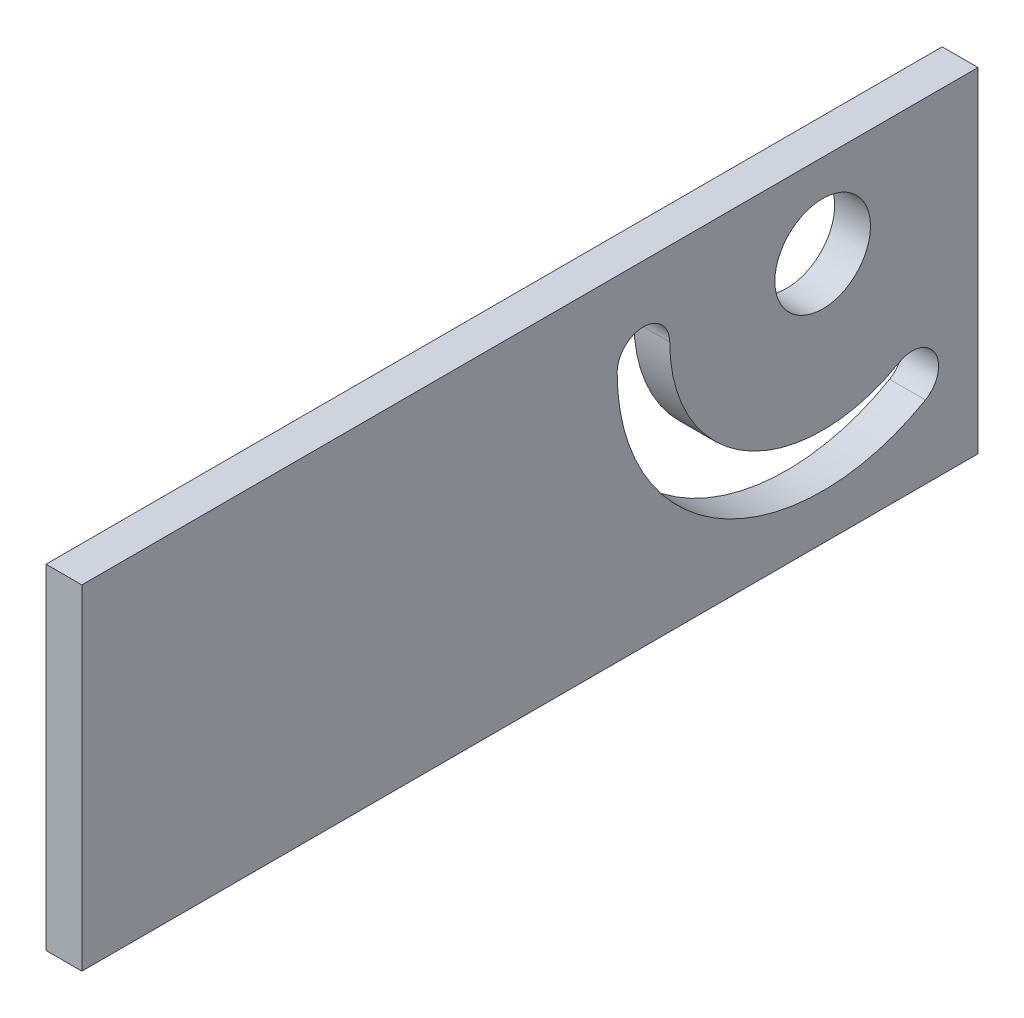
ISO-10303-21;
HEADER;
FILE_DESCRIPTION(('STEP AP214'),'2;1');
FILE_NAME('part.step','',(''),(''),'','','');
FILE_SCHEMA(('AUTOMOTIVE_DESIGN { 1 0 10303 214 1 1 1 1 }'));
ENDSEC;
DATA;
#1=APPLICATION_CONTEXT('core data for automotive mechanical design processes');
#2=APPLICATION_PROTOCOL_DEFINITION('international standard','automotive_design',2000,#1);
#3=PRODUCT_CONTEXT('',#1,'mechanical');
#4=PRODUCT('Part','Part','',(#3));
#5=PRODUCT_RELATED_PRODUCT_CATEGORY('part','',(#4));
#6=PRODUCT_DEFINITION_FORMATION('','',#4);
#7=PRODUCT_DEFINITION_CONTEXT('part definition',#1,'design');
#8=PRODUCT_DEFINITION('design','',#6,#7);
#9=PRODUCT_DEFINITION_SHAPE('','',#8);
#10=(LENGTH_UNIT() NAMED_UNIT(*) SI_UNIT(.MILLI.,.METRE.));
#11=(NAMED_UNIT(*) PLANE_ANGLE_UNIT() SI_UNIT($,.RADIAN.));
#12=(NAMED_UNIT(*) SI_UNIT($,.STERADIAN.) SOLID_ANGLE_UNIT());
#13=UNCERTAINTY_MEASURE_WITH_UNIT(LENGTH_MEASURE(1.E-05),#10,'distance_accuracy_value','');
#14=(GEOMETRIC_REPRESENTATION_CONTEXT(3) GLOBAL_UNCERTAINTY_ASSIGNED_CONTEXT((#13)) GLOBAL_UNIT_ASSIGNED_CONTEXT((#10,
#11,#12)) REPRESENTATION_CONTEXT('',''));
#15=CARTESIAN_POINT('',(0.,0.,0.));
#16=DIRECTION('',(0.,0.,1.));
#17=DIRECTION('',(1.,0.,0.));
#18=AXIS2_PLACEMENT_3D('',#15,#16,#17);
#19=CARTESIAN_POINT('',(-64.,87.,50.5));
#20=DIRECTION('',(1.,0.,0.));
#21=DIRECTION('',(0.,0.,-1.));
#22=AXIS2_PLACEMENT_3D('',#19,#20,#21);
#23=CYLINDRICAL_SURFACE('',#22,17.2);
#24=CARTESIAN_POINT('',(-61.,87.,50.5));
#25=DIRECTION('',(-1.,0.,0.));
#26=DIRECTION('',(0.,0.,1.));
#27=AXIS2_PLACEMENT_3D('',#24,#25,#26);
#28=CIRCLE('',#27,17.2);
#29=CARTESIAN_POINT('',(-61.,72.1043630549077,41.8999999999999));
#30=VERTEX_POINT('',#29);
#31=CARTESIAN_POINT('',(-61.,87.,67.7));
#32=VERTEX_POINT('',#31);
#33=EDGE_CURVE('E150',#30,#32,#28,.T.);
#34=ORIENTED_EDGE('',*,*,#33,.F.);
#35=DIRECTION('',(1.,0.,0.));
#36=VECTOR('',#35,1.);
#37=CARTESIAN_POINT('',(-64.,72.1043630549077,41.8999999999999));
#38=LINE('',#37,#36);
#39=CARTESIAN_POINT('',(-64.,72.1043630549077,41.8999999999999));
#40=VERTEX_POINT('',#39);
#41=EDGE_CURVE('E11',#40,#30,#38,.T.);
#42=ORIENTED_EDGE('',*,*,#41,.F.);
#43=CARTESIAN_POINT('',(-64.,87.,50.5));
#44=DIRECTION('',(-1.,0.,0.));
#45=DIRECTION('',(0.,0.,1.));
#46=AXIS2_PLACEMENT_3D('',#43,#44,#45);
#47=CIRCLE('',#46,17.2);
#48=CARTESIAN_POINT('',(-64.,87.,67.7));
#49=VERTEX_POINT('',#48);
#50=EDGE_CURVE('E121',#40,#49,#47,.T.);
#51=ORIENTED_EDGE('',*,*,#50,.T.);
#52=DIRECTION('',(1.,0.,0.));
#53=VECTOR('',#52,1.);
#54=CARTESIAN_POINT('',(-64.,87.,67.7));
#55=LINE('',#54,#53);
#56=EDGE_CURVE('E54',#49,#32,#55,.T.);
#57=ORIENTED_EDGE('',*,*,#56,.T.);
#58=EDGE_LOOP('',(#34,#42,#51,#57));
#59=FACE_BOUND('',#58,.T.);
#60=ADVANCED_FACE('F35',(#59),#23,.F.);
#61=CARTESIAN_POINT('',(-64.,74.0096189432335,42.9999999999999));
#62=DIRECTION('',(1.,0.,0.));
#63=DIRECTION('',(0.,0.,-1.));
#64=AXIS2_PLACEMENT_3D('',#61,#62,#63);
#65=CYLINDRICAL_SURFACE('',#64,2.2);
#66=CARTESIAN_POINT('',(-61.,74.0096189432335,42.9999999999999));
#67=DIRECTION('',(-1.,0.,0.));
#68=DIRECTION('',(0.,0.,1.));
#69=AXIS2_PLACEMENT_3D('',#66,#67,#68);
#70=CIRCLE('',#69,2.2);
#71=CARTESIAN_POINT('',(-61.,75.9148748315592,44.0999999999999));
#72=VERTEX_POINT('',#71);
#73=EDGE_CURVE('E126',#30,#72,#70,.F.);
#74=ORIENTED_EDGE('',*,*,#73,.T.);
#75=DIRECTION('',(1.,0.,0.));
#76=VECTOR('',#75,1.);
#77=CARTESIAN_POINT('',(-64.,75.9148748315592,44.0999999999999));
#78=LINE('',#77,#76);
#79=CARTESIAN_POINT('',(-64.,75.9148748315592,44.0999999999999));
#80=VERTEX_POINT('',#79);
#81=EDGE_CURVE('E45',#80,#72,#78,.T.);
#82=ORIENTED_EDGE('',*,*,#81,.F.);
#83=CARTESIAN_POINT('',(-64.,74.0096189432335,42.9999999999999));
#84=DIRECTION('',(-1.,0.,0.));
#85=DIRECTION('',(0.,0.,1.));
#86=AXIS2_PLACEMENT_3D('',#83,#84,#85);
#87=CIRCLE('',#86,2.2);
#88=EDGE_CURVE('E116',#40,#80,#87,.F.);
#89=ORIENTED_EDGE('',*,*,#88,.F.);
#90=ORIENTED_EDGE('',*,*,#41,.T.);
#91=EDGE_LOOP('',(#74,#82,#89,#90));
#92=FACE_BOUND('',#91,.T.);
#93=ADVANCED_FACE('F124',(#92),#65,.F.);
#94=CARTESIAN_POINT('',(-64.,87.,50.5));
#95=DIRECTION('',(1.,0.,0.));
#96=DIRECTION('',(0.,0.,-1.));
#97=AXIS2_PLACEMENT_3D('',#94,#95,#96);
#98=CYLINDRICAL_SURFACE('',#97,12.8);
#99=CARTESIAN_POINT('',(-61.,87.,50.5));
#100=DIRECTION('',(-1.,0.,0.));
#101=DIRECTION('',(0.,0.,1.));
#102=AXIS2_PLACEMENT_3D('',#99,#100,#101);
#103=CIRCLE('',#102,12.8);
#104=CARTESIAN_POINT('',(-61.,87.,63.3));
#105=VERTEX_POINT('',#104);
#106=EDGE_CURVE('E147',#72,#105,#103,.T.);
#107=ORIENTED_EDGE('',*,*,#106,.T.);
#108=DIRECTION('',(1.,0.,0.));
#109=VECTOR('',#108,1.);
#110=CARTESIAN_POINT('',(-64.,87.,63.3));
#111=LINE('',#110,#109);
#112=CARTESIAN_POINT('',(-64.,87.,63.3));
#113=VERTEX_POINT('',#112);
#114=EDGE_CURVE('E80',#113,#105,#111,.T.);
#115=ORIENTED_EDGE('',*,*,#114,.F.);
#116=CARTESIAN_POINT('',(-64.,87.,50.5));
#117=DIRECTION('',(-1.,0.,0.));
#118=DIRECTION('',(0.,0.,1.));
#119=AXIS2_PLACEMENT_3D('',#116,#117,#118);
#120=CIRCLE('',#119,12.8);
#121=EDGE_CURVE('E108',#80,#113,#120,.T.);
#122=ORIENTED_EDGE('',*,*,#121,.F.);
#123=ORIENTED_EDGE('',*,*,#81,.T.);
#124=EDGE_LOOP('',(#107,#115,#122,#123));
#125=FACE_BOUND('',#124,.T.);
#126=ADVANCED_FACE('F110',(#125),#98,.T.);
#127=CARTESIAN_POINT('',(-64.,0.,112.5));
#128=DIRECTION('',(0.,0.,-1.));
#129=DIRECTION('',(-1.,0.,0.));
#130=AXIS2_PLACEMENT_3D('',#127,#128,#129);
#131=PLANE('',#130);
#132=DIRECTION('',(0.,1.,0.));
#133=VECTOR('',#132,1.);
#134=CARTESIAN_POINT('',(-61.,0.,112.5));
#135=LINE('',#134,#133);
#136=CARTESIAN_POINT('',(-61.,66.,112.5));
#137=VERTEX_POINT('',#136);
#138=CARTESIAN_POINT('',(-61.,94.,112.5));
#139=VERTEX_POINT('',#138);
#140=EDGE_CURVE('E162',#137,#139,#135,.T.);
#141=ORIENTED_EDGE('',*,*,#140,.T.);
#142=DIRECTION('',(1.,0.,0.));
#143=VECTOR('',#142,1.);
#144=CARTESIAN_POINT('',(-64.,94.,112.5));
#145=LINE('',#144,#143);
#146=CARTESIAN_POINT('',(-64.,94.,112.5));
#147=VERTEX_POINT('',#146);
#148=EDGE_CURVE('E39',#147,#139,#145,.T.);
#149=ORIENTED_EDGE('',*,*,#148,.F.);
#150=DIRECTION('',(0.,1.,0.));
#151=VECTOR('',#150,1.);
#152=CARTESIAN_POINT('',(-64.,0.,112.5));
#153=LINE('',#152,#151);
#154=CARTESIAN_POINT('',(-64.,66.,112.5));
#155=VERTEX_POINT('',#154);
#156=EDGE_CURVE('E146',#155,#147,#153,.T.);
#157=ORIENTED_EDGE('',*,*,#156,.F.);
#158=DIRECTION('',(1.,0.,0.));
#159=VECTOR('',#158,1.);
#160=CARTESIAN_POINT('',(-64.,66.,112.5));
#161=LINE('',#160,#159);
#162=EDGE_CURVE('E131',#155,#137,#161,.T.);
#163=ORIENTED_EDGE('',*,*,#162,.T.);
#164=EDGE_LOOP('',(#141,#149,#157,#163));
#165=FACE_BOUND('',#164,.T.);
#166=ADVANCED_FACE('F37',(#165),#131,.F.);
#167=CARTESIAN_POINT('',(-64.,94.,0.));
#168=DIRECTION('',(0.,-1.,0.));
#169=DIRECTION('',(0.,0.,-1.));
#170=AXIS2_PLACEMENT_3D('',#167,#168,#169);
#171=PLANE('',#170);
#172=DIRECTION('',(0.,0.,-1.));
#173=VECTOR('',#172,1.);
#174=CARTESIAN_POINT('',(-61.,94.,0.));
#175=LINE('',#174,#173);
#176=CARTESIAN_POINT('',(-61.,94.,37.5));
#177=VERTEX_POINT('',#176);
#178=EDGE_CURVE('E160',#139,#177,#175,.T.);
#179=ORIENTED_EDGE('',*,*,#178,.T.);
#180=DIRECTION('',(1.,0.,0.));
#181=VECTOR('',#180,1.);
#182=CARTESIAN_POINT('',(-64.,94.,37.5));
#183=LINE('',#182,#181);
#184=CARTESIAN_POINT('',(-64.,94.,37.5));
#185=VERTEX_POINT('',#184);
#186=EDGE_CURVE('E135',#185,#177,#183,.T.);
#187=ORIENTED_EDGE('',*,*,#186,.F.);
#188=DIRECTION('',(0.,0.,-1.));
#189=VECTOR('',#188,1.);
#190=CARTESIAN_POINT('',(-64.,94.,0.));
#191=LINE('',#190,#189);
#192=EDGE_CURVE('E93',#147,#185,#191,.T.);
#193=ORIENTED_EDGE('',*,*,#192,.F.);
#194=ORIENTED_EDGE('',*,*,#148,.T.);
#195=EDGE_LOOP('',(#179,#187,#193,#194));
#196=FACE_BOUND('',#195,.T.);
#197=ADVANCED_FACE('F186',(#196),#171,.F.);
#198=CARTESIAN_POINT('',(-64.,0.,37.5));
#199=DIRECTION('',(0.,0.,-1.));
#200=DIRECTION('',(-1.,0.,0.));
#201=AXIS2_PLACEMENT_3D('',#198,#199,#200);
#202=PLANE('',#201);
#203=DIRECTION('',(0.,1.,0.));
#204=VECTOR('',#203,1.);
#205=CARTESIAN_POINT('',(-61.,0.,37.5));
#206=LINE('',#205,#204);
#207=CARTESIAN_POINT('',(-61.,66.,37.5));
#208=VERTEX_POINT('',#207);
#209=EDGE_CURVE('E157',#208,#177,#206,.T.);
#210=ORIENTED_EDGE('',*,*,#209,.F.);
#211=DIRECTION('',(1.,0.,0.));
#212=VECTOR('',#211,1.);
#213=CARTESIAN_POINT('',(-64.,66.,37.5));
#214=LINE('',#213,#212);
#215=CARTESIAN_POINT('',(-64.,66.,37.5));
#216=VERTEX_POINT('',#215);
#217=EDGE_CURVE('E134',#216,#208,#214,.T.);
#218=ORIENTED_EDGE('',*,*,#217,.F.);
#219=DIRECTION('',(0.,1.,0.));
#220=VECTOR('',#219,1.);
#221=CARTESIAN_POINT('',(-64.,0.,37.5));
#222=LINE('',#221,#220);
#223=EDGE_CURVE('E171',#216,#185,#222,.T.);
#224=ORIENTED_EDGE('',*,*,#223,.T.);
#225=ORIENTED_EDGE('',*,*,#186,.T.);
#226=EDGE_LOOP('',(#210,#218,#224,#225));
#227=FACE_BOUND('',#226,.T.);
#228=ADVANCED_FACE('F187',(#227),#202,.T.);
#229=CARTESIAN_POINT('',(-64.,87.,50.5));
#230=DIRECTION('',(1.,0.,0.));
#231=DIRECTION('',(0.,0.,-1.));
#232=AXIS2_PLACEMENT_3D('',#229,#230,#231);
#233=CYLINDRICAL_SURFACE('',#232,4.00000000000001);
#234=CARTESIAN_POINT('',(-64.,87.,50.5));
#235=DIRECTION('',(-1.,0.,0.));
#236=DIRECTION('',(0.,0.,1.));
#237=AXIS2_PLACEMENT_3D('',#234,#235,#236);
#238=CIRCLE('',#237,4.00000000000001);
#239=CARTESIAN_POINT('',(-64.,87.,54.5));
#240=VERTEX_POINT('',#239);
#241=EDGE_CURVE('E166',#240,#240,#238,.F.);
#242=ORIENTED_EDGE('',*,*,#241,.F.);
#243=EDGE_LOOP('',(#242));
#244=FACE_BOUND('',#243,.T.);
#245=CARTESIAN_POINT('',(-61.,87.,50.5));
#246=DIRECTION('',(-1.,0.,0.));
#247=DIRECTION('',(0.,0.,1.));
#248=AXIS2_PLACEMENT_3D('',#245,#246,#247);
#249=CIRCLE('',#248,4.00000000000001);
#250=CARTESIAN_POINT('',(-61.,87.,54.5));
#251=VERTEX_POINT('',#250);
#252=EDGE_CURVE('E152',#251,#251,#249,.F.);
#253=ORIENTED_EDGE('',*,*,#252,.T.);
#254=EDGE_LOOP('',(#253));
#255=FACE_BOUND('',#254,.T.);
#256=ADVANCED_FACE('F192',(#244,#255),#233,.F.);
#257=CARTESIAN_POINT('',(-64.,66.,0.));
#258=DIRECTION('',(0.,1.,0.));
#259=DIRECTION('',(0.,0.,1.));
#260=AXIS2_PLACEMENT_3D('',#257,#258,#259);
#261=PLANE('',#260);
#262=DIRECTION('',(0.,0.,1.));
#263=VECTOR('',#262,1.);
#264=CARTESIAN_POINT('',(-61.,66.,0.));
#265=LINE('',#264,#263);
#266=EDGE_CURVE('E155',#208,#137,#265,.T.);
#267=ORIENTED_EDGE('',*,*,#266,.T.);
#268=ORIENTED_EDGE('',*,*,#162,.F.);
#269=DIRECTION('',(0.,0.,1.));
#270=VECTOR('',#269,1.);
#271=CARTESIAN_POINT('',(-64.,66.,0.));
#272=LINE('',#271,#270);
#273=EDGE_CURVE('E169',#216,#155,#272,.T.);
#274=ORIENTED_EDGE('',*,*,#273,.F.);
#275=ORIENTED_EDGE('',*,*,#217,.T.);
#276=EDGE_LOOP('',(#267,#268,#274,#275));
#277=FACE_BOUND('',#276,.T.);
#278=ADVANCED_FACE('F189',(#277),#261,.F.);
#279=CARTESIAN_POINT('',(-64.,87.,65.5));
#280=DIRECTION('',(1.,0.,0.));
#281=DIRECTION('',(0.,0.,-1.));
#282=AXIS2_PLACEMENT_3D('',#279,#280,#281);
#283=CYLINDRICAL_SURFACE('',#282,2.20000000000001);
#284=CARTESIAN_POINT('',(-61.,87.,65.5));
#285=DIRECTION('',(-1.,0.,0.));
#286=DIRECTION('',(0.,0.,1.));
#287=AXIS2_PLACEMENT_3D('',#284,#285,#286);
#288=CIRCLE('',#287,2.20000000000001);
#289=EDGE_CURVE('E143',#32,#105,#288,.T.);
#290=ORIENTED_EDGE('',*,*,#289,.F.);
#291=ORIENTED_EDGE('',*,*,#56,.F.);
#292=CARTESIAN_POINT('',(-64.,87.,65.5));
#293=DIRECTION('',(-1.,0.,0.));
#294=DIRECTION('',(0.,0.,1.));
#295=AXIS2_PLACEMENT_3D('',#292,#293,#294);
#296=CIRCLE('',#295,2.20000000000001);
#297=EDGE_CURVE('E115',#49,#113,#296,.T.);
#298=ORIENTED_EDGE('',*,*,#297,.T.);
#299=ORIENTED_EDGE('',*,*,#114,.T.);
#300=EDGE_LOOP('',(#290,#291,#298,#299));
#301=FACE_BOUND('',#300,.T.);
#302=ADVANCED_FACE('F191',(#301),#283,.F.);
#303=CARTESIAN_POINT('',(-64.,0.,0.));
#304=DIRECTION('',(-1.,0.,0.));
#305=DIRECTION('',(0.,0.,1.));
#306=AXIS2_PLACEMENT_3D('',#303,#304,#305);
#307=PLANE('',#306);
#308=ORIENTED_EDGE('',*,*,#156,.T.);
#309=ORIENTED_EDGE('',*,*,#192,.T.);
#310=ORIENTED_EDGE('',*,*,#223,.F.);
#311=ORIENTED_EDGE('',*,*,#273,.T.);
#312=EDGE_LOOP('',(#308,#309,#310,#311));
#313=FACE_BOUND('',#312,.T.);
#314=ORIENTED_EDGE('',*,*,#241,.T.);
#315=EDGE_LOOP('',(#314));
#316=FACE_BOUND('',#315,.T.);
#317=ORIENTED_EDGE('',*,*,#50,.F.);
#318=ORIENTED_EDGE('',*,*,#88,.T.);
#319=ORIENTED_EDGE('',*,*,#121,.T.);
#320=ORIENTED_EDGE('',*,*,#297,.F.);
#321=EDGE_LOOP('',(#317,#318,#319,#320));
#322=FACE_BOUND('',#321,.T.);
#323=ADVANCED_FACE('F120',(#313,#316,#322),#307,.T.);
#324=CARTESIAN_POINT('',(-61.,0.,0.));
#325=DIRECTION('',(-1.,0.,0.));
#326=DIRECTION('',(0.,0.,1.));
#327=AXIS2_PLACEMENT_3D('',#324,#325,#326);
#328=PLANE('',#327);
#329=ORIENTED_EDGE('',*,*,#140,.F.);
#330=ORIENTED_EDGE('',*,*,#266,.F.);
#331=ORIENTED_EDGE('',*,*,#209,.T.);
#332=ORIENTED_EDGE('',*,*,#178,.F.);
#333=EDGE_LOOP('',(#329,#330,#331,#332));
#334=FACE_BOUND('',#333,.T.);
#335=ORIENTED_EDGE('',*,*,#252,.F.);
#336=EDGE_LOOP('',(#335));
#337=FACE_BOUND('',#336,.T.);
#338=ORIENTED_EDGE('',*,*,#33,.T.);
#339=ORIENTED_EDGE('',*,*,#289,.T.);
#340=ORIENTED_EDGE('',*,*,#106,.F.);
#341=ORIENTED_EDGE('',*,*,#73,.F.);
#342=EDGE_LOOP('',(#338,#339,#340,#341));
#343=FACE_BOUND('',#342,.T.);
#344=ADVANCED_FACE('F184',(#334,#337,#343),#328,.F.);
#345=CLOSED_SHELL('',(#60,#93,#126,#166,#197,#228,#256,#278,#302,#323,#344));
#346=MANIFOLD_SOLID_BREP('B2',#345);
#347=ADVANCED_BREP_SHAPE_REPRESENTATION('',(#18,#346),#14);
#348=SHAPE_DEFINITION_REPRESENTATION(#9,#347);
ENDSEC;
END-ISO-10303-21;
